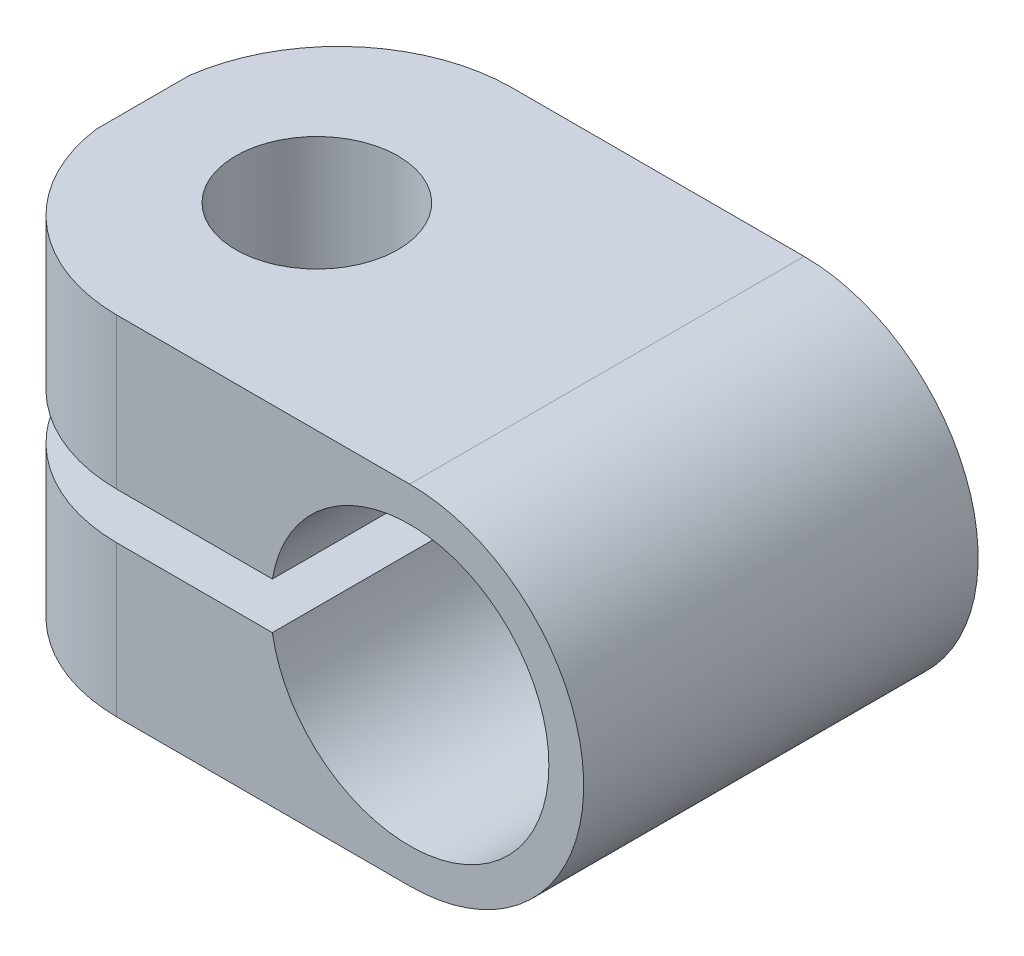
from build123d import *

# Parameters (mm, degrees)
EXTRUSION1_DEPTH        = 17
ESQUISSE2_R             = 6
ENL_V_MAT_EXTRU_1_DEPTH = 36.640566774
ESQUISSE3_W             = 16.436428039
ESQUISSE3_H             = 2
ENL_V_MAT_EXTRU_2_DEPTH = 36.640566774
ENL_V_MAT_EXTRU_5_DEPTH = 36.640566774
ESQUISSE7_R             = 3.5
ENL_V_MAT_EXTRU_6_DEPTH = 36.640566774


with BuildPart() as part:
    # Esquisse1 → Extrusion1 (new body)
    with BuildSketch(Plane.XY):
        with BuildLine():
            Line((0, 0), (0, 15))
            Line((0, 15), (20, 15))
            ThreePointArc((20, 15), (27.5, 7.5), (20, 0))
            Line((20, 0), (0, 0))
        make_face()
    extrude(amount=EXTRUSION1_DEPTH)

    # Esquisse2 → Enl_v. mat.-Extru.1 (cut, through all)
    with BuildSketch(Plane.XY.offset(17)):
        with Locations((20, 7.5)):
            Circle(ESQUISSE2_R)
    extrude(amount=-ENL_V_MAT_EXTRU_1_DEPTH, mode=Mode.SUBTRACT)

    # Esquisse3 → Enl_v. mat.-Extru.2 (cut, through all)
    with BuildSketch(Plane.XY.offset(17)):
        with Locations((8.21821402, 7.5)):
            Rectangle(ESQUISSE3_W, ESQUISSE3_H)
    extrude(amount=-ENL_V_MAT_EXTRU_2_DEPTH, mode=Mode.SUBTRACT)

    # Esquisse4 → Enl_v. mat.-Extru.5 (cut, through all)
    with BuildSketch(Plane.XZ):
        with BuildLine():
            Line((7.5, 17), (7.5, 18.289737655))
            Line((7.5, 18.289737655), (-1.23232486, 18.289737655))
            Line((-1.23232486, 18.289737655), (-1.23232486, -1.289737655))
            Line((-1.23232486, -1.289737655), (7.5, -1.289737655))
            Line((7.5, -1.289737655), (7.5, 0))
            ThreePointArc((7.5, 0), (1.809210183, 2.537538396), (0, 8.5))
            ThreePointArc((0, 8.5), (1.809210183, 14.462461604), (7.5, 17))
        make_face()
    extrude(amount=-ENL_V_MAT_EXTRU_5_DEPTH, mode=Mode.SUBTRACT)

    # Esquisse7 → Enl_v. mat.-Extru.6 (cut, through all)
    with BuildSketch(Plane.XZ):
        with Locations(Location((7.5, 8.5, 0), (0, 0, 270))):
            Circle(ESQUISSE7_R)
    extrude(amount=-ENL_V_MAT_EXTRU_6_DEPTH, mode=Mode.SUBTRACT)


solid = part.part
